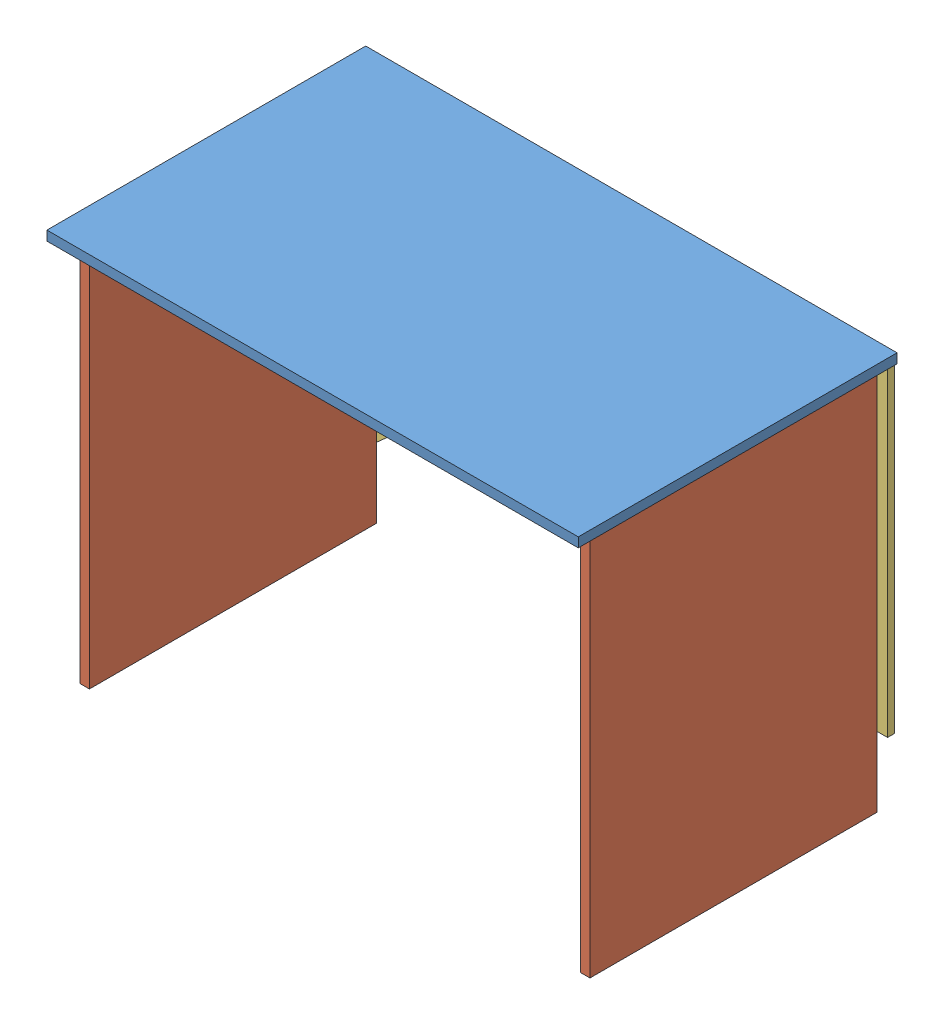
SolidWorks assembly Assem1.SLDASM, configuration Default (file format 9000). Lengths in mm.
Overall size (1000 750 600).
4 component instances, 3 part files, 8 mates.
Components (placement in the parent):
- Part2-1: Part2.SLDPRT [Default] at (521.8126 559.4079 766.458) x (1 0 0) z (0 0 -1) size (1000 18 600)
- Part3-2: Part3.SLDPRT [Default] at (-158.8794 263.5892 501.2093) size (18 742 540)
- Part3-3: Part3.SLDPRT [Default] at (783.1206 263.5892 501.2093) size (18 742 540)
- Part1-2: Part1.SLDPRT [Default] at (336.8972 373.106 493.7071) x (-1 0 0) z (0 0 -1) size (1000 600 13)
Mates (geometry in assembly coordinates):
- Coincident11: coincident anti-aligned: line of Part2-1 through (-158.8794 541.4079 1033.7071) axis (0 0 -1); line of Part3-2 through (-158.8794 541.4079 913.7071) axis (0 0 1)
- Perpendicular3: perpendicular: plane of Part2-1 through (521.8126 541.4079 766.458) normal (0 -1 0); plane of Part3-2 through (-140.8794 263.5892 501.2093) normal (1 0 0)
- Coincident14: coincident aligned: line of Part2-1 through (801.1206 541.4079 493.7071) axis (0 0 1); line of Part3-3 through (801.1206 541.4079 553.7071) axis (0 0 1)
- Perpendicular4: perpendicular: plane of Part2-1 through (521.8126 541.4079 766.458) normal (0 -1 0); plane of Part3-3 through (783.1206 263.5892 501.2093) normal (-1 0 0)
- Coincident16: coincident: point of Part2-1; point of Part3-3
- Coincident25: coincident anti-aligned: plane of Part3-2 through (-140.8794 541.4079 493.7071) normal (0 0 -1); plane of Part1-2 through (321.1206 -529.9264 493.7071) normal (0 0 1)
- Coincident26: coincident aligned: plane of Part2-1 through (-178.8794 541.4079 1075.7071) normal (-1 0 0); plane of Part1-2 through (-178.8794 541.4079 480.7071) normal (-1 0 0)
- Coincident27: coincident anti-aligned: plane of Part2-1 through (521.8126 541.4079 766.458) normal (0 -1 0); plane of Part1-2 through (821.1206 541.4079 480.7071) normal (0 1 0)
